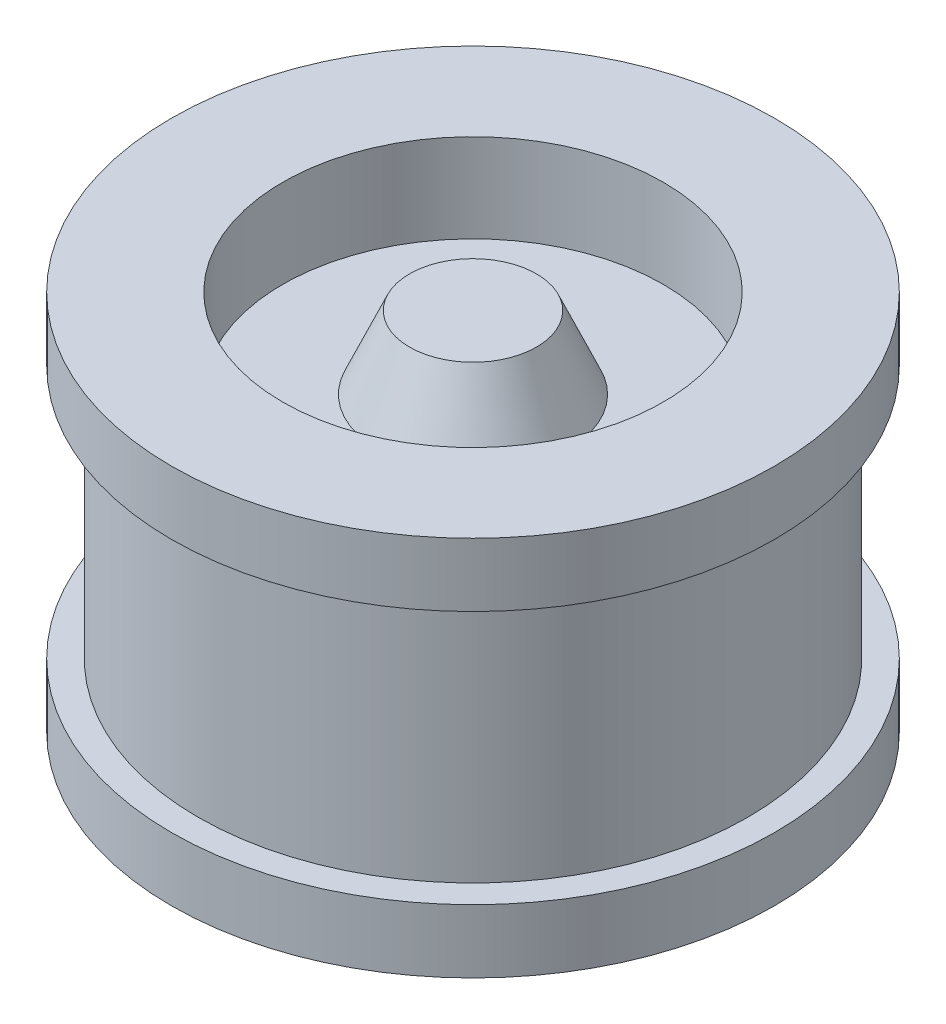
ISO-10303-21;
HEADER;
FILE_DESCRIPTION(('STEP AP214'),'2;1');
FILE_NAME('part.step','',(''),(''),'','','');
FILE_SCHEMA(('AUTOMOTIVE_DESIGN { 1 0 10303 214 1 1 1 1 }'));
ENDSEC;
DATA;
#1=APPLICATION_CONTEXT('core data for automotive mechanical design processes');
#2=APPLICATION_PROTOCOL_DEFINITION('international standard','automotive_design',2000,#1);
#3=PRODUCT_CONTEXT('',#1,'mechanical');
#4=PRODUCT('Part','Part','',(#3));
#5=PRODUCT_RELATED_PRODUCT_CATEGORY('part','',(#4));
#6=PRODUCT_DEFINITION_FORMATION('','',#4);
#7=PRODUCT_DEFINITION_CONTEXT('part definition',#1,'design');
#8=PRODUCT_DEFINITION('design','',#6,#7);
#9=PRODUCT_DEFINITION_SHAPE('','',#8);
#10=(LENGTH_UNIT() NAMED_UNIT(*) SI_UNIT(.MILLI.,.METRE.));
#11=(NAMED_UNIT(*) PLANE_ANGLE_UNIT() SI_UNIT($,.RADIAN.));
#12=(NAMED_UNIT(*) SI_UNIT($,.STERADIAN.) SOLID_ANGLE_UNIT());
#13=UNCERTAINTY_MEASURE_WITH_UNIT(LENGTH_MEASURE(1.E-05),#10,'distance_accuracy_value','');
#14=(GEOMETRIC_REPRESENTATION_CONTEXT(3) GLOBAL_UNCERTAINTY_ASSIGNED_CONTEXT((#13)) GLOBAL_UNIT_ASSIGNED_CONTEXT((#10,
#11,#12)) REPRESENTATION_CONTEXT('',''));
#15=CARTESIAN_POINT('',(0.,0.,0.));
#16=DIRECTION('',(0.,0.,1.));
#17=DIRECTION('',(1.,0.,0.));
#18=AXIS2_PLACEMENT_3D('',#15,#16,#17);
#19=CARTESIAN_POINT('',(0.,20.,0.));
#20=DIRECTION('',(0.,1.,0.));
#21=DIRECTION('',(0.,0.,1.));
#22=AXIS2_PLACEMENT_3D('',#19,#20,#21);
#23=CYLINDRICAL_SURFACE('',#22,3.);
#24=CARTESIAN_POINT('',(0.,0.,0.));
#25=DIRECTION('',(0.,1.,0.));
#26=DIRECTION('',(0.,0.,1.));
#27=AXIS2_PLACEMENT_3D('',#24,#25,#26);
#28=CIRCLE('',#27,3.);
#29=CARTESIAN_POINT('',(0.,0.,3.));
#30=VERTEX_POINT('',#29);
#31=EDGE_CURVE('E152',#30,#30,#28,.T.);
#32=ORIENTED_EDGE('',*,*,#31,.T.);
#33=EDGE_LOOP('',(#32));
#34=FACE_BOUND('',#33,.T.);
#35=DIRECTION('',(0.,1.,0.));
#36=VECTOR('',#35,1.);
#37=CARTESIAN_POINT('',(-2.95803989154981,4.,0.499999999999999));
#38=LINE('',#37,#36);
#39=CARTESIAN_POINT('',(-2.95803989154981,4.,0.499999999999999));
#40=VERTEX_POINT('',#39);
#41=CARTESIAN_POINT('',(-2.95803989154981,8.,0.499999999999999));
#42=VERTEX_POINT('',#41);
#43=EDGE_CURVE('E50',#40,#42,#38,.T.);
#44=ORIENTED_EDGE('',*,*,#43,.F.);
#45=CARTESIAN_POINT('',(0.,4.,0.));
#46=DIRECTION('',(0.,1.,0.));
#47=DIRECTION('',(0.,0.,-1.));
#48=AXIS2_PLACEMENT_3D('',#45,#46,#47);
#49=CIRCLE('',#48,3.);
#50=CARTESIAN_POINT('',(-2.95803989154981,4.,-0.5));
#51=VERTEX_POINT('',#50);
#52=EDGE_CURVE('E45',#51,#40,#49,.T.);
#53=ORIENTED_EDGE('',*,*,#52,.F.);
#54=DIRECTION('',(0.,1.,0.));
#55=VECTOR('',#54,1.);
#56=CARTESIAN_POINT('',(-2.95803989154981,4.,-0.5));
#57=LINE('',#56,#55);
#58=CARTESIAN_POINT('',(-2.95803989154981,8.,-0.5));
#59=VERTEX_POINT('',#58);
#60=EDGE_CURVE('E157',#51,#59,#57,.T.);
#61=ORIENTED_EDGE('',*,*,#60,.T.);
#62=CARTESIAN_POINT('',(0.,8.,0.));
#63=DIRECTION('',(0.,1.,0.));
#64=DIRECTION('',(0.,0.,1.));
#65=AXIS2_PLACEMENT_3D('',#62,#63,#64);
#66=CIRCLE('',#65,3.);
#67=CARTESIAN_POINT('',(-0.500000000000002,8.,-2.95803989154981));
#68=VERTEX_POINT('',#67);
#69=EDGE_CURVE('E144',#68,#59,#66,.T.);
#70=ORIENTED_EDGE('',*,*,#69,.F.);
#71=DIRECTION('',(0.,1.,0.));
#72=VECTOR('',#71,1.);
#73=CARTESIAN_POINT('',(-0.500000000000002,4.,-2.95803989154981));
#74=LINE('',#73,#72);
#75=CARTESIAN_POINT('',(-0.500000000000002,4.,-2.95803989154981));
#76=VERTEX_POINT('',#75);
#77=EDGE_CURVE('E255',#76,#68,#74,.T.);
#78=ORIENTED_EDGE('',*,*,#77,.F.);
#79=CARTESIAN_POINT('',(0.,4.,0.));
#80=DIRECTION('',(0.,1.,0.));
#81=DIRECTION('',(0.,0.,-1.));
#82=AXIS2_PLACEMENT_3D('',#79,#80,#81);
#83=CIRCLE('',#82,3.);
#84=CARTESIAN_POINT('',(0.499999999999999,4.,-2.95803989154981));
#85=VERTEX_POINT('',#84);
#86=EDGE_CURVE('E236',#85,#76,#83,.T.);
#87=ORIENTED_EDGE('',*,*,#86,.F.);
#88=DIRECTION('',(0.,1.,0.));
#89=VECTOR('',#88,1.);
#90=CARTESIAN_POINT('',(0.499999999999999,4.,-2.95803989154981));
#91=LINE('',#90,#89);
#92=CARTESIAN_POINT('',(0.499999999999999,8.,-2.95803989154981));
#93=VERTEX_POINT('',#92);
#94=EDGE_CURVE('E246',#85,#93,#91,.T.);
#95=ORIENTED_EDGE('',*,*,#94,.T.);
#96=CARTESIAN_POINT('',(2.95803989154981,8.,-0.499999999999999));
#97=VERTEX_POINT('',#96);
#98=EDGE_CURVE('E295',#97,#93,#66,.T.);
#99=ORIENTED_EDGE('',*,*,#98,.F.);
#100=DIRECTION('',(0.,1.,0.));
#101=VECTOR('',#100,1.);
#102=CARTESIAN_POINT('',(2.95803989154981,4.,-0.499999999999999));
#103=LINE('',#102,#101);
#104=CARTESIAN_POINT('',(2.95803989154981,4.,-0.499999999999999));
#105=VERTEX_POINT('',#104);
#106=EDGE_CURVE('E204',#105,#97,#103,.T.);
#107=ORIENTED_EDGE('',*,*,#106,.F.);
#108=CARTESIAN_POINT('',(0.,4.,0.));
#109=DIRECTION('',(0.,1.,0.));
#110=DIRECTION('',(0.,0.,-1.));
#111=AXIS2_PLACEMENT_3D('',#108,#109,#110);
#112=CIRCLE('',#111,3.);
#113=CARTESIAN_POINT('',(2.95803989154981,4.,0.5));
#114=VERTEX_POINT('',#113);
#115=EDGE_CURVE('E186',#114,#105,#112,.T.);
#116=ORIENTED_EDGE('',*,*,#115,.F.);
#117=DIRECTION('',(0.,1.,0.));
#118=VECTOR('',#117,1.);
#119=CARTESIAN_POINT('',(2.95803989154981,4.,0.5));
#120=LINE('',#119,#118);
#121=CARTESIAN_POINT('',(2.95803989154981,8.,0.5));
#122=VERTEX_POINT('',#121);
#123=EDGE_CURVE('E196',#114,#122,#120,.T.);
#124=ORIENTED_EDGE('',*,*,#123,.T.);
#125=CARTESIAN_POINT('',(0.499999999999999,8.,2.95803989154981));
#126=VERTEX_POINT('',#125);
#127=EDGE_CURVE('E155',#126,#122,#66,.T.);
#128=ORIENTED_EDGE('',*,*,#127,.F.);
#129=DIRECTION('',(0.,1.,0.));
#130=VECTOR('',#129,1.);
#131=CARTESIAN_POINT('',(0.499999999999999,4.,2.95803989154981));
#132=LINE('',#131,#130);
#133=CARTESIAN_POINT('',(0.499999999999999,4.,2.95803989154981));
#134=VERTEX_POINT('',#133);
#135=EDGE_CURVE('E224',#134,#126,#132,.T.);
#136=ORIENTED_EDGE('',*,*,#135,.F.);
#137=CARTESIAN_POINT('',(0.,4.,0.));
#138=DIRECTION('',(0.,1.,0.));
#139=DIRECTION('',(0.,0.,-1.));
#140=AXIS2_PLACEMENT_3D('',#137,#138,#139);
#141=CIRCLE('',#140,3.);
#142=CARTESIAN_POINT('',(-0.500000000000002,4.,2.95803989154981));
#143=VERTEX_POINT('',#142);
#144=EDGE_CURVE('E216',#143,#134,#141,.T.);
#145=ORIENTED_EDGE('',*,*,#144,.F.);
#146=DIRECTION('',(0.,1.,0.));
#147=VECTOR('',#146,1.);
#148=CARTESIAN_POINT('',(-0.500000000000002,4.,2.95803989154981));
#149=LINE('',#148,#147);
#150=CARTESIAN_POINT('',(-0.500000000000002,8.,2.95803989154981));
#151=VERTEX_POINT('',#150);
#152=EDGE_CURVE('E226',#143,#151,#149,.T.);
#153=ORIENTED_EDGE('',*,*,#152,.T.);
#154=EDGE_CURVE('E153',#42,#151,#66,.T.);
#155=ORIENTED_EDGE('',*,*,#154,.F.);
#156=EDGE_LOOP('',(#44,#53,#61,#70,#78,#87,#95,#99,#107,#116,#124,#128,#136,#145,#153,#155));
#157=FACE_BOUND('',#156,.T.);
#158=ADVANCED_FACE('F30',(#34,#157),#23,.T.);
#159=CARTESIAN_POINT('',(0.,20.,0.));
#160=DIRECTION('',(0.,1.,0.));
#161=DIRECTION('',(0.,0.,1.));
#162=AXIS2_PLACEMENT_3D('',#159,#160,#161);
#163=CYLINDRICAL_SURFACE('',#162,6.5);
#164=CARTESIAN_POINT('',(0.,2.,0.));
#165=DIRECTION('',(0.,1.,0.));
#166=DIRECTION('',(0.,0.,1.));
#167=AXIS2_PLACEMENT_3D('',#164,#165,#166);
#168=CIRCLE('',#167,6.5);
#169=CARTESIAN_POINT('',(0.,2.,6.5));
#170=VERTEX_POINT('',#169);
#171=EDGE_CURVE('E290',#170,#170,#168,.T.);
#172=ORIENTED_EDGE('',*,*,#171,.F.);
#173=EDGE_LOOP('',(#172));
#174=FACE_BOUND('',#173,.T.);
#175=DIRECTION('',(0.,1.,0.));
#176=VECTOR('',#175,1.);
#177=CARTESIAN_POINT('',(-6.48074069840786,4.,0.500000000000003));
#178=LINE('',#177,#176);
#179=CARTESIAN_POINT('',(-6.48074069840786,4.,0.499999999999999));
#180=VERTEX_POINT('',#179);
#181=CARTESIAN_POINT('',(-6.48074069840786,8.,0.500000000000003));
#182=VERTEX_POINT('',#181);
#183=EDGE_CURVE('E179',#180,#182,#178,.T.);
#184=ORIENTED_EDGE('',*,*,#183,.T.);
#185=CARTESIAN_POINT('',(0.,8.,0.));
#186=DIRECTION('',(0.,1.,0.));
#187=DIRECTION('',(0.,0.,1.));
#188=AXIS2_PLACEMENT_3D('',#185,#186,#187);
#189=CIRCLE('',#188,6.5);
#190=CARTESIAN_POINT('',(-0.500000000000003,8.,6.48074069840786));
#191=VERTEX_POINT('',#190);
#192=EDGE_CURVE('E296',#182,#191,#189,.T.);
#193=ORIENTED_EDGE('',*,*,#192,.T.);
#194=DIRECTION('',(0.,1.,0.));
#195=VECTOR('',#194,1.);
#196=CARTESIAN_POINT('',(-0.500000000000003,4.,6.48074069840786));
#197=LINE('',#196,#195);
#198=CARTESIAN_POINT('',(-0.500000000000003,4.,6.48074069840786));
#199=VERTEX_POINT('',#198);
#200=EDGE_CURVE('E229',#199,#191,#197,.T.);
#201=ORIENTED_EDGE('',*,*,#200,.F.);
#202=CARTESIAN_POINT('',(0.,4.,0.));
#203=DIRECTION('',(0.,-1.,0.));
#204=DIRECTION('',(0.,0.,-1.));
#205=AXIS2_PLACEMENT_3D('',#202,#203,#204);
#206=CIRCLE('',#205,6.5);
#207=CARTESIAN_POINT('',(0.499999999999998,4.,6.48074069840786));
#208=VERTEX_POINT('',#207);
#209=EDGE_CURVE('E211',#208,#199,#206,.T.);
#210=ORIENTED_EDGE('',*,*,#209,.F.);
#211=DIRECTION('',(0.,1.,0.));
#212=VECTOR('',#211,1.);
#213=CARTESIAN_POINT('',(0.499999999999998,4.,6.48074069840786));
#214=LINE('',#213,#212);
#215=CARTESIAN_POINT('',(0.499999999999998,8.,6.48074069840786));
#216=VERTEX_POINT('',#215);
#217=EDGE_CURVE('E221',#208,#216,#214,.T.);
#218=ORIENTED_EDGE('',*,*,#217,.T.);
#219=CARTESIAN_POINT('',(6.48074069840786,8.,0.5));
#220=VERTEX_POINT('',#219);
#221=EDGE_CURVE('E297',#216,#220,#189,.T.);
#222=ORIENTED_EDGE('',*,*,#221,.T.);
#223=DIRECTION('',(0.,1.,0.));
#224=VECTOR('',#223,1.);
#225=CARTESIAN_POINT('',(6.48074069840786,4.,0.5));
#226=LINE('',#225,#224);
#227=CARTESIAN_POINT('',(6.48074069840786,4.,0.5));
#228=VERTEX_POINT('',#227);
#229=EDGE_CURVE('E199',#228,#220,#226,.T.);
#230=ORIENTED_EDGE('',*,*,#229,.F.);
#231=CARTESIAN_POINT('',(0.,4.,0.));
#232=DIRECTION('',(0.,-1.,0.));
#233=DIRECTION('',(0.,0.,-1.));
#234=AXIS2_PLACEMENT_3D('',#231,#232,#233);
#235=CIRCLE('',#234,6.5);
#236=CARTESIAN_POINT('',(6.48074069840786,4.,-0.499999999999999));
#237=VERTEX_POINT('',#236);
#238=EDGE_CURVE('E192',#237,#228,#235,.T.);
#239=ORIENTED_EDGE('',*,*,#238,.F.);
#240=DIRECTION('',(0.,1.,0.));
#241=VECTOR('',#240,1.);
#242=CARTESIAN_POINT('',(6.48074069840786,4.,-0.499999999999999));
#243=LINE('',#242,#241);
#244=CARTESIAN_POINT('',(6.48074069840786,8.,-0.499999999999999));
#245=VERTEX_POINT('',#244);
#246=EDGE_CURVE('E201',#237,#245,#243,.T.);
#247=ORIENTED_EDGE('',*,*,#246,.T.);
#248=CARTESIAN_POINT('',(0.499999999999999,8.,-6.48074069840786));
#249=VERTEX_POINT('',#248);
#250=EDGE_CURVE('E293',#245,#249,#189,.T.);
#251=ORIENTED_EDGE('',*,*,#250,.T.);
#252=DIRECTION('',(0.,1.,0.));
#253=VECTOR('',#252,1.);
#254=CARTESIAN_POINT('',(0.499999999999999,4.,-6.48074069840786));
#255=LINE('',#254,#253);
#256=CARTESIAN_POINT('',(0.499999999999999,4.,-6.48074069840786));
#257=VERTEX_POINT('',#256);
#258=EDGE_CURVE('E249',#257,#249,#255,.T.);
#259=ORIENTED_EDGE('',*,*,#258,.F.);
#260=CARTESIAN_POINT('',(0.,4.,0.));
#261=DIRECTION('',(0.,-1.,0.));
#262=DIRECTION('',(0.,0.,-1.));
#263=AXIS2_PLACEMENT_3D('',#260,#261,#262);
#264=CIRCLE('',#263,6.5);
#265=CARTESIAN_POINT('',(-0.500000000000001,4.,-6.48074069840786));
#266=VERTEX_POINT('',#265);
#267=EDGE_CURVE('E242',#266,#257,#264,.T.);
#268=ORIENTED_EDGE('',*,*,#267,.F.);
#269=DIRECTION('',(0.,1.,0.));
#270=VECTOR('',#269,1.);
#271=CARTESIAN_POINT('',(-0.500000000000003,4.,-6.48074069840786));
#272=LINE('',#271,#270);
#273=CARTESIAN_POINT('',(-0.500000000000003,8.,-6.48074069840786));
#274=VERTEX_POINT('',#273);
#275=EDGE_CURVE('E252',#266,#274,#272,.T.);
#276=ORIENTED_EDGE('',*,*,#275,.T.);
#277=CARTESIAN_POINT('',(-6.48074069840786,8.,-0.5));
#278=VERTEX_POINT('',#277);
#279=EDGE_CURVE('E294',#274,#278,#189,.T.);
#280=ORIENTED_EDGE('',*,*,#279,.T.);
#281=DIRECTION('',(0.,1.,0.));
#282=VECTOR('',#281,1.);
#283=CARTESIAN_POINT('',(-6.48074069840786,4.,-0.5));
#284=LINE('',#283,#282);
#285=CARTESIAN_POINT('',(-6.48074069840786,4.,-0.5));
#286=VERTEX_POINT('',#285);
#287=EDGE_CURVE('E160',#286,#278,#284,.T.);
#288=ORIENTED_EDGE('',*,*,#287,.F.);
#289=CARTESIAN_POINT('',(0.,4.,0.));
#290=DIRECTION('',(0.,-1.,0.));
#291=DIRECTION('',(0.,0.,-1.));
#292=AXIS2_PLACEMENT_3D('',#289,#290,#291);
#293=CIRCLE('',#292,6.5);
#294=EDGE_CURVE('E174',#180,#286,#293,.T.);
#295=ORIENTED_EDGE('',*,*,#294,.F.);
#296=EDGE_LOOP('',(#184,#193,#201,#210,#218,#222,#230,#239,#247,#251,#259,#268,#276,#280,#288,#295));
#297=FACE_BOUND('',#296,.T.);
#298=ADVANCED_FACE('F321',(#174,#297),#163,.F.);
#299=CARTESIAN_POINT('',(3.,8.,0.));
#300=DIRECTION('',(0.,1.,0.));
#301=DIRECTION('',(0.,0.,1.));
#302=AXIS2_PLACEMENT_3D('',#299,#300,#301);
#303=PLANE('',#302);
#304=DIRECTION('',(-1.,0.,0.));
#305=VECTOR('',#304,1.);
#306=CARTESIAN_POINT('',(-2.95803989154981,8.,0.499999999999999));
#307=LINE('',#306,#305);
#308=EDGE_CURVE('E165',#42,#182,#307,.T.);
#309=ORIENTED_EDGE('',*,*,#308,.F.);
#310=ORIENTED_EDGE('',*,*,#154,.T.);
#311=DIRECTION('',(0.,0.,-1.));
#312=VECTOR('',#311,1.);
#313=CARTESIAN_POINT('',(-0.500000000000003,8.,6.48074069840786));
#314=LINE('',#313,#312);
#315=EDGE_CURVE('E206',#191,#151,#314,.T.);
#316=ORIENTED_EDGE('',*,*,#315,.F.);
#317=ORIENTED_EDGE('',*,*,#192,.F.);
#318=EDGE_LOOP('',(#309,#310,#316,#317));
#319=FACE_BOUND('',#318,.T.);
#320=ADVANCED_FACE('F326',(#319),#303,.F.);
#321=DIRECTION('',(1.,0.,0.));
#322=VECTOR('',#321,1.);
#323=CARTESIAN_POINT('',(-2.95803989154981,8.,-0.5));
#324=LINE('',#323,#322);
#325=EDGE_CURVE('E148',#278,#59,#324,.T.);
#326=ORIENTED_EDGE('',*,*,#325,.F.);
#327=ORIENTED_EDGE('',*,*,#279,.F.);
#328=DIRECTION('',(0.,0.,-1.));
#329=VECTOR('',#328,1.);
#330=CARTESIAN_POINT('',(-0.500000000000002,8.,-2.95803989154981));
#331=LINE('',#330,#329);
#332=EDGE_CURVE('E150',#68,#274,#331,.T.);
#333=ORIENTED_EDGE('',*,*,#332,.F.);
#334=ORIENTED_EDGE('',*,*,#69,.T.);
#335=EDGE_LOOP('',(#326,#327,#333,#334));
#336=FACE_BOUND('',#335,.T.);
#337=ADVANCED_FACE('F145',(#336),#303,.F.);
#338=DIRECTION('',(1.,0.,0.));
#339=VECTOR('',#338,1.);
#340=CARTESIAN_POINT('',(6.48074069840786,8.,-0.499999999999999));
#341=LINE('',#340,#339);
#342=EDGE_CURVE('E182',#97,#245,#341,.T.);
#343=ORIENTED_EDGE('',*,*,#342,.F.);
#344=ORIENTED_EDGE('',*,*,#98,.T.);
#345=DIRECTION('',(0.,0.,1.));
#346=VECTOR('',#345,1.);
#347=CARTESIAN_POINT('',(0.499999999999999,8.,-2.95803989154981));
#348=LINE('',#347,#346);
#349=EDGE_CURVE('E233',#249,#93,#348,.T.);
#350=ORIENTED_EDGE('',*,*,#349,.F.);
#351=ORIENTED_EDGE('',*,*,#250,.F.);
#352=EDGE_LOOP('',(#343,#344,#350,#351));
#353=FACE_BOUND('',#352,.T.);
#354=ADVANCED_FACE('F391',(#353),#303,.F.);
#355=DIRECTION('',(-1.,0.,0.));
#356=VECTOR('',#355,1.);
#357=CARTESIAN_POINT('',(6.48074069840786,8.,0.5));
#358=LINE('',#357,#356);
#359=EDGE_CURVE('E184',#220,#122,#358,.T.);
#360=ORIENTED_EDGE('',*,*,#359,.F.);
#361=ORIENTED_EDGE('',*,*,#221,.F.);
#362=DIRECTION('',(0.,0.,1.));
#363=VECTOR('',#362,1.);
#364=CARTESIAN_POINT('',(0.499999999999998,8.,6.48074069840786));
#365=LINE('',#364,#363);
#366=EDGE_CURVE('E209',#126,#216,#365,.T.);
#367=ORIENTED_EDGE('',*,*,#366,.F.);
#368=ORIENTED_EDGE('',*,*,#127,.T.);
#369=EDGE_LOOP('',(#360,#361,#367,#368));
#370=FACE_BOUND('',#369,.T.);
#371=ADVANCED_FACE('F332',(#370),#303,.F.);
#372=CARTESIAN_POINT('',(0.,0.,0.));
#373=DIRECTION('',(0.,1.,0.));
#374=DIRECTION('',(0.,0.,1.));
#375=AXIS2_PLACEMENT_3D('',#372,#373,#374);
#376=PLANE('',#375);
#377=CARTESIAN_POINT('',(0.,0.,0.));
#378=DIRECTION('',(0.,-1.,0.));
#379=DIRECTION('',(0.,0.,-1.));
#380=AXIS2_PLACEMENT_3D('',#377,#378,#379);
#381=CIRCLE('',#380,0.999999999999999);
#382=CARTESIAN_POINT('',(0.,0.,-0.999999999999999));
#383=VERTEX_POINT('',#382);
#384=EDGE_CURVE('E257',#383,#383,#381,.T.);
#385=ORIENTED_EDGE('',*,*,#384,.F.);
#386=EDGE_LOOP('',(#385));
#387=FACE_BOUND('',#386,.T.);
#388=ORIENTED_EDGE('',*,*,#31,.F.);
#389=EDGE_LOOP('',(#388));
#390=FACE_BOUND('',#389,.T.);
#391=ADVANCED_FACE('F32',(#387,#390),#376,.F.);
#392=CARTESIAN_POINT('',(6.5,2.,0.));
#393=DIRECTION('',(0.,1.,0.));
#394=DIRECTION('',(0.,0.,1.));
#395=AXIS2_PLACEMENT_3D('',#392,#393,#394);
#396=PLANE('',#395);
#397=CARTESIAN_POINT('',(0.,2.,0.));
#398=DIRECTION('',(0.,1.,0.));
#399=DIRECTION('',(0.,0.,1.));
#400=AXIS2_PLACEMENT_3D('',#397,#398,#399);
#401=CIRCLE('',#400,9.5);
#402=CARTESIAN_POINT('',(0.,2.,9.5));
#403=VERTEX_POINT('',#402);
#404=EDGE_CURVE('E287',#403,#403,#401,.T.);
#405=ORIENTED_EDGE('',*,*,#404,.F.);
#406=EDGE_LOOP('',(#405));
#407=FACE_BOUND('',#406,.T.);
#408=ORIENTED_EDGE('',*,*,#171,.T.);
#409=EDGE_LOOP('',(#408));
#410=FACE_BOUND('',#409,.T.);
#411=ADVANCED_FACE('F334',(#407,#410),#396,.F.);
#412=CARTESIAN_POINT('',(0.,20.,0.));
#413=DIRECTION('',(0.,1.,0.));
#414=DIRECTION('',(0.,0.,1.));
#415=AXIS2_PLACEMENT_3D('',#412,#413,#414);
#416=CYLINDRICAL_SURFACE('',#415,9.5);
#417=CARTESIAN_POINT('',(0.,4.,0.));
#418=DIRECTION('',(0.,1.,0.));
#419=DIRECTION('',(0.,0.,1.));
#420=AXIS2_PLACEMENT_3D('',#417,#418,#419);
#421=CIRCLE('',#420,9.5);
#422=CARTESIAN_POINT('',(0.,4.,9.5));
#423=VERTEX_POINT('',#422);
#424=EDGE_CURVE('E284',#423,#423,#421,.T.);
#425=ORIENTED_EDGE('',*,*,#424,.F.);
#426=EDGE_LOOP('',(#425));
#427=FACE_BOUND('',#426,.T.);
#428=ORIENTED_EDGE('',*,*,#404,.T.);
#429=EDGE_LOOP('',(#428));
#430=FACE_BOUND('',#429,.T.);
#431=ADVANCED_FACE('F337',(#427,#430),#416,.T.);
#432=CARTESIAN_POINT('',(9.5,4.,0.));
#433=DIRECTION('',(0.,-1.,0.));
#434=DIRECTION('',(0.,0.,-1.));
#435=AXIS2_PLACEMENT_3D('',#432,#433,#434);
#436=PLANE('',#435);
#437=CARTESIAN_POINT('',(0.,4.,0.));
#438=DIRECTION('',(0.,1.,0.));
#439=DIRECTION('',(0.,0.,1.));
#440=AXIS2_PLACEMENT_3D('',#437,#438,#439);
#441=CIRCLE('',#440,8.66254051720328);
#442=CARTESIAN_POINT('',(0.,4.,8.66254051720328));
#443=VERTEX_POINT('',#442);
#444=EDGE_CURVE('E281',#443,#443,#441,.T.);
#445=ORIENTED_EDGE('',*,*,#444,.F.);
#446=EDGE_LOOP('',(#445));
#447=FACE_BOUND('',#446,.T.);
#448=ORIENTED_EDGE('',*,*,#424,.T.);
#449=EDGE_LOOP('',(#448));
#450=FACE_BOUND('',#449,.T.);
#451=ADVANCED_FACE('F341',(#447,#450),#436,.F.);
#452=CARTESIAN_POINT('',(0.,20.,0.));
#453=DIRECTION('',(0.,1.,0.));
#454=DIRECTION('',(0.,0.,1.));
#455=AXIS2_PLACEMENT_3D('',#452,#453,#454);
#456=CYLINDRICAL_SURFACE('',#455,8.66254051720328);
#457=CARTESIAN_POINT('',(0.,12.,0.));
#458=DIRECTION('',(0.,1.,0.));
#459=DIRECTION('',(0.,0.,1.));
#460=AXIS2_PLACEMENT_3D('',#457,#458,#459);
#461=CIRCLE('',#460,8.66254051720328);
#462=CARTESIAN_POINT('',(0.,12.,8.66254051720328));
#463=VERTEX_POINT('',#462);
#464=EDGE_CURVE('E278',#463,#463,#461,.T.);
#465=ORIENTED_EDGE('',*,*,#464,.F.);
#466=EDGE_LOOP('',(#465));
#467=FACE_BOUND('',#466,.T.);
#468=ORIENTED_EDGE('',*,*,#444,.T.);
#469=EDGE_LOOP('',(#468));
#470=FACE_BOUND('',#469,.T.);
#471=ADVANCED_FACE('F345',(#467,#470),#456,.T.);
#472=CARTESIAN_POINT('',(8.66254051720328,12.,0.));
#473=DIRECTION('',(0.,1.,0.));
#474=DIRECTION('',(0.,0.,1.));
#475=AXIS2_PLACEMENT_3D('',#472,#473,#474);
#476=PLANE('',#475);
#477=CARTESIAN_POINT('',(0.,12.,0.));
#478=DIRECTION('',(0.,1.,0.));
#479=DIRECTION('',(0.,0.,1.));
#480=AXIS2_PLACEMENT_3D('',#477,#478,#479);
#481=CIRCLE('',#480,9.49999999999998);
#482=CARTESIAN_POINT('',(0.,12.,9.49999999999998));
#483=VERTEX_POINT('',#482);
#484=EDGE_CURVE('E275',#483,#483,#481,.T.);
#485=ORIENTED_EDGE('',*,*,#484,.F.);
#486=EDGE_LOOP('',(#485));
#487=FACE_BOUND('',#486,.T.);
#488=ORIENTED_EDGE('',*,*,#464,.T.);
#489=EDGE_LOOP('',(#488));
#490=FACE_BOUND('',#489,.T.);
#491=ADVANCED_FACE('F349',(#487,#490),#476,.F.);
#492=CARTESIAN_POINT('',(0.,20.,0.));
#493=DIRECTION('',(0.,1.,0.));
#494=DIRECTION('',(0.,0.,1.));
#495=AXIS2_PLACEMENT_3D('',#492,#493,#494);
#496=CYLINDRICAL_SURFACE('',#495,9.49999999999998);
#497=CARTESIAN_POINT('',(0.,14.,0.));
#498=DIRECTION('',(0.,1.,0.));
#499=DIRECTION('',(0.,0.,1.));
#500=AXIS2_PLACEMENT_3D('',#497,#498,#499);
#501=CIRCLE('',#500,9.49999999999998);
#502=CARTESIAN_POINT('',(0.,14.,9.49999999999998));
#503=VERTEX_POINT('',#502);
#504=EDGE_CURVE('E272',#503,#503,#501,.T.);
#505=ORIENTED_EDGE('',*,*,#504,.F.);
#506=EDGE_LOOP('',(#505));
#507=FACE_BOUND('',#506,.T.);
#508=ORIENTED_EDGE('',*,*,#484,.T.);
#509=EDGE_LOOP('',(#508));
#510=FACE_BOUND('',#509,.T.);
#511=ADVANCED_FACE('F353',(#507,#510),#496,.T.);
#512=CARTESIAN_POINT('',(9.49999999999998,14.,0.));
#513=DIRECTION('',(0.,-1.,0.));
#514=DIRECTION('',(0.,0.,-1.));
#515=AXIS2_PLACEMENT_3D('',#512,#513,#514);
#516=PLANE('',#515);
#517=CARTESIAN_POINT('',(0.,14.,0.));
#518=DIRECTION('',(0.,1.,0.));
#519=DIRECTION('',(0.,0.,1.));
#520=AXIS2_PLACEMENT_3D('',#517,#518,#519);
#521=CIRCLE('',#520,5.9993782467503);
#522=CARTESIAN_POINT('',(0.,14.,5.9993782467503));
#523=VERTEX_POINT('',#522);
#524=EDGE_CURVE('E269',#523,#523,#521,.T.);
#525=ORIENTED_EDGE('',*,*,#524,.F.);
#526=EDGE_LOOP('',(#525));
#527=FACE_BOUND('',#526,.T.);
#528=ORIENTED_EDGE('',*,*,#504,.T.);
#529=EDGE_LOOP('',(#528));
#530=FACE_BOUND('',#529,.T.);
#531=ADVANCED_FACE('F357',(#527,#530),#516,.F.);
#532=CARTESIAN_POINT('',(0.,20.,0.));
#533=DIRECTION('',(0.,1.,0.));
#534=DIRECTION('',(0.,0.,1.));
#535=AXIS2_PLACEMENT_3D('',#532,#533,#534);
#536=CYLINDRICAL_SURFACE('',#535,5.9993782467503);
#537=CARTESIAN_POINT('',(0.,11.212054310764,0.));
#538=DIRECTION('',(0.,1.,0.));
#539=DIRECTION('',(0.,0.,1.));
#540=AXIS2_PLACEMENT_3D('',#537,#538,#539);
#541=CIRCLE('',#540,5.9993782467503);
#542=CARTESIAN_POINT('',(0.,11.212054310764,5.9993782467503));
#543=VERTEX_POINT('',#542);
#544=EDGE_CURVE('E266',#543,#543,#541,.T.);
#545=ORIENTED_EDGE('',*,*,#544,.F.);
#546=EDGE_LOOP('',(#545));
#547=FACE_BOUND('',#546,.T.);
#548=ORIENTED_EDGE('',*,*,#524,.T.);
#549=EDGE_LOOP('',(#548));
#550=FACE_BOUND('',#549,.T.);
#551=ADVANCED_FACE('F361',(#547,#550),#536,.F.);
#552=CARTESIAN_POINT('',(5.9993782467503,11.212054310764,0.));
#553=DIRECTION('',(0.,-1.,0.));
#554=DIRECTION('',(0.,0.,-1.));
#555=AXIS2_PLACEMENT_3D('',#552,#553,#554);
#556=PLANE('',#555);
#557=CARTESIAN_POINT('',(0.,11.212054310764,0.));
#558=DIRECTION('',(0.,1.,0.));
#559=DIRECTION('',(0.,0.,1.));
#560=AXIS2_PLACEMENT_3D('',#557,#558,#559);
#561=CIRCLE('',#560,3.);
#562=CARTESIAN_POINT('',(0.,11.212054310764,3.));
#563=VERTEX_POINT('',#562);
#564=EDGE_CURVE('E263',#563,#563,#561,.T.);
#565=ORIENTED_EDGE('',*,*,#564,.F.);
#566=EDGE_LOOP('',(#565));
#567=FACE_BOUND('',#566,.T.);
#568=ORIENTED_EDGE('',*,*,#544,.T.);
#569=EDGE_LOOP('',(#568));
#570=FACE_BOUND('',#569,.T.);
#571=ADVANCED_FACE('F365',(#567,#570),#556,.F.);
#572=CARTESIAN_POINT('',(0.,11.212054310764,0.));
#573=DIRECTION('',(0.,-1.,0.));
#574=DIRECTION('',(0.,0.,-1.));
#575=AXIS2_PLACEMENT_3D('',#572,#573,#574);
#576=CONICAL_SURFACE('',#575,3.,0.412052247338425);
#577=CARTESIAN_POINT('',(0.,13.5,0.));
#578=DIRECTION('',(0.,1.,0.));
#579=DIRECTION('',(0.,0.,1.));
#580=AXIS2_PLACEMENT_3D('',#577,#578,#579);
#581=CIRCLE('',#580,2.);
#582=CARTESIAN_POINT('',(0.,13.5,2.));
#583=VERTEX_POINT('',#582);
#584=EDGE_CURVE('E260',#583,#583,#581,.T.);
#585=ORIENTED_EDGE('',*,*,#584,.F.);
#586=EDGE_LOOP('',(#585));
#587=FACE_BOUND('',#586,.T.);
#588=ORIENTED_EDGE('',*,*,#564,.T.);
#589=EDGE_LOOP('',(#588));
#590=FACE_BOUND('',#589,.T.);
#591=ADVANCED_FACE('F369',(#587,#590),#576,.T.);
#592=CARTESIAN_POINT('',(2.,13.5,0.));
#593=DIRECTION('',(0.,-1.,0.));
#594=DIRECTION('',(0.,0.,-1.));
#595=AXIS2_PLACEMENT_3D('',#592,#593,#594);
#596=PLANE('',#595);
#597=ORIENTED_EDGE('',*,*,#584,.T.);
#598=EDGE_LOOP('',(#597));
#599=FACE_BOUND('',#598,.T.);
#600=ADVANCED_FACE('F373',(#599),#596,.F.);
#601=CARTESIAN_POINT('',(0.,5.5,0.));
#602=DIRECTION('',(0.,-1.,0.));
#603=DIRECTION('',(0.,0.,-1.));
#604=AXIS2_PLACEMENT_3D('',#601,#602,#603);
#605=CYLINDRICAL_SURFACE('',#604,0.999999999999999);
#606=CARTESIAN_POINT('',(0.,5.25,0.));
#607=DIRECTION('',(0.,-1.,0.));
#608=DIRECTION('',(0.,0.,-1.));
#609=AXIS2_PLACEMENT_3D('',#606,#607,#608);
#610=CIRCLE('',#609,0.999999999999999);
#611=CARTESIAN_POINT('',(0.,5.25,-0.999999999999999));
#612=VERTEX_POINT('',#611);
#613=EDGE_CURVE('E11',#612,#612,#610,.F.);
#614=ORIENTED_EDGE('',*,*,#613,.T.);
#615=EDGE_LOOP('',(#614));
#616=FACE_BOUND('',#615,.T.);
#617=ORIENTED_EDGE('',*,*,#384,.T.);
#618=EDGE_LOOP('',(#617));
#619=FACE_BOUND('',#618,.T.);
#620=ADVANCED_FACE('F317',(#616,#619),#605,.F.);
#621=CARTESIAN_POINT('',(0.,5.5,0.));
#622=DIRECTION('',(0.,-1.,0.));
#623=DIRECTION('',(0.,0.,-1.));
#624=AXIS2_PLACEMENT_3D('',#621,#622,#623);
#625=PLANE('',#624);
#626=CARTESIAN_POINT('',(0.,5.5,0.));
#627=DIRECTION('',(0.,-1.,0.));
#628=DIRECTION('',(0.,0.,-1.));
#629=AXIS2_PLACEMENT_3D('',#626,#627,#628);
#630=CIRCLE('',#629,0.749999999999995);
#631=CARTESIAN_POINT('',(0.,5.5,-0.749999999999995));
#632=VERTEX_POINT('',#631);
#633=EDGE_CURVE('E38',#632,#632,#630,.T.);
#634=ORIENTED_EDGE('',*,*,#633,.T.);
#635=EDGE_LOOP('',(#634));
#636=FACE_BOUND('',#635,.T.);
#637=ADVANCED_FACE('F303',(#636),#625,.T.);
#638=CARTESIAN_POINT('',(0.,5.5,0.));
#639=DIRECTION('',(0.,-1.,0.));
#640=DIRECTION('',(0.,0.,-1.));
#641=AXIS2_PLACEMENT_3D('',#638,#639,#640);
#642=CONICAL_SURFACE('',#641,0.749999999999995,0.785398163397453);
#643=ORIENTED_EDGE('',*,*,#613,.F.);
#644=EDGE_LOOP('',(#643));
#645=FACE_BOUND('',#644,.T.);
#646=ORIENTED_EDGE('',*,*,#633,.F.);
#647=EDGE_LOOP('',(#646));
#648=FACE_BOUND('',#647,.T.);
#649=ADVANCED_FACE('F305',(#645,#648),#642,.F.);
#650=CARTESIAN_POINT('',(-0.500000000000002,4.,-2.95803989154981));
#651=DIRECTION('',(1.,0.,0.));
#652=DIRECTION('',(0.,0.,-1.));
#653=AXIS2_PLACEMENT_3D('',#650,#651,#652);
#654=PLANE('',#653);
#655=ORIENTED_EDGE('',*,*,#332,.T.);
#656=ORIENTED_EDGE('',*,*,#275,.F.);
#657=DIRECTION('',(0.,0.,-1.));
#658=VECTOR('',#657,1.);
#659=CARTESIAN_POINT('',(-0.500000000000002,4.,-2.95803989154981));
#660=LINE('',#659,#658);
#661=EDGE_CURVE('E239',#76,#266,#660,.T.);
#662=ORIENTED_EDGE('',*,*,#661,.F.);
#663=ORIENTED_EDGE('',*,*,#77,.T.);
#664=EDGE_LOOP('',(#655,#656,#662,#663));
#665=FACE_BOUND('',#664,.T.);
#666=ADVANCED_FACE('F307',(#665),#654,.F.);
#667=CARTESIAN_POINT('',(0.499999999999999,4.,-2.95803989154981));
#668=DIRECTION('',(-1.,0.,0.));
#669=DIRECTION('',(0.,0.,1.));
#670=AXIS2_PLACEMENT_3D('',#667,#668,#669);
#671=PLANE('',#670);
#672=ORIENTED_EDGE('',*,*,#349,.T.);
#673=ORIENTED_EDGE('',*,*,#94,.F.);
#674=DIRECTION('',(0.,0.,1.));
#675=VECTOR('',#674,1.);
#676=CARTESIAN_POINT('',(0.499999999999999,4.,-2.95803989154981));
#677=LINE('',#676,#675);
#678=EDGE_CURVE('E244',#257,#85,#677,.T.);
#679=ORIENTED_EDGE('',*,*,#678,.F.);
#680=ORIENTED_EDGE('',*,*,#258,.T.);
#681=EDGE_LOOP('',(#672,#673,#679,#680));
#682=FACE_BOUND('',#681,.T.);
#683=ADVANCED_FACE('F314',(#682),#671,.F.);
#684=CARTESIAN_POINT('',(0.,4.,0.));
#685=DIRECTION('',(0.,-1.,0.));
#686=DIRECTION('',(0.,0.,-1.));
#687=AXIS2_PLACEMENT_3D('',#684,#685,#686);
#688=PLANE('',#687);
#689=ORIENTED_EDGE('',*,*,#86,.T.);
#690=ORIENTED_EDGE('',*,*,#661,.T.);
#691=ORIENTED_EDGE('',*,*,#267,.T.);
#692=ORIENTED_EDGE('',*,*,#678,.T.);
#693=EDGE_LOOP('',(#689,#690,#691,#692));
#694=FACE_BOUND('',#693,.T.);
#695=ADVANCED_FACE('F453',(#694),#688,.T.);
#696=CARTESIAN_POINT('',(-0.500000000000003,4.,6.48074069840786));
#697=DIRECTION('',(1.,0.,0.));
#698=DIRECTION('',(0.,0.,-1.));
#699=AXIS2_PLACEMENT_3D('',#696,#697,#698);
#700=PLANE('',#699);
#701=ORIENTED_EDGE('',*,*,#315,.T.);
#702=ORIENTED_EDGE('',*,*,#152,.F.);
#703=DIRECTION('',(0.,0.,-1.));
#704=VECTOR('',#703,1.);
#705=CARTESIAN_POINT('',(-0.500000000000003,4.,6.48074069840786));
#706=LINE('',#705,#704);
#707=EDGE_CURVE('E214',#199,#143,#706,.T.);
#708=ORIENTED_EDGE('',*,*,#707,.F.);
#709=ORIENTED_EDGE('',*,*,#200,.T.);
#710=EDGE_LOOP('',(#701,#702,#708,#709));
#711=FACE_BOUND('',#710,.T.);
#712=ADVANCED_FACE('F423',(#711),#700,.F.);
#713=CARTESIAN_POINT('',(0.499999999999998,4.,6.48074069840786));
#714=DIRECTION('',(-1.,0.,0.));
#715=DIRECTION('',(0.,0.,1.));
#716=AXIS2_PLACEMENT_3D('',#713,#714,#715);
#717=PLANE('',#716);
#718=ORIENTED_EDGE('',*,*,#366,.T.);
#719=ORIENTED_EDGE('',*,*,#217,.F.);
#720=DIRECTION('',(0.,0.,1.));
#721=VECTOR('',#720,1.);
#722=CARTESIAN_POINT('',(0.499999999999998,4.,6.48074069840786));
#723=LINE('',#722,#721);
#724=EDGE_CURVE('E218',#134,#208,#723,.T.);
#725=ORIENTED_EDGE('',*,*,#724,.F.);
#726=ORIENTED_EDGE('',*,*,#135,.T.);
#727=EDGE_LOOP('',(#718,#719,#725,#726));
#728=FACE_BOUND('',#727,.T.);
#729=ADVANCED_FACE('F431',(#728),#717,.F.);
#730=CARTESIAN_POINT('',(0.,4.,0.));
#731=DIRECTION('',(0.,-1.,0.));
#732=DIRECTION('',(0.,0.,-1.));
#733=AXIS2_PLACEMENT_3D('',#730,#731,#732);
#734=PLANE('',#733);
#735=ORIENTED_EDGE('',*,*,#209,.T.);
#736=ORIENTED_EDGE('',*,*,#707,.T.);
#737=ORIENTED_EDGE('',*,*,#144,.T.);
#738=ORIENTED_EDGE('',*,*,#724,.T.);
#739=EDGE_LOOP('',(#735,#736,#737,#738));
#740=FACE_BOUND('',#739,.T.);
#741=ADVANCED_FACE('F429',(#740),#734,.T.);
#742=CARTESIAN_POINT('',(6.48074069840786,4.,-0.499999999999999));
#743=DIRECTION('',(0.,0.,1.));
#744=DIRECTION('',(1.,0.,0.));
#745=AXIS2_PLACEMENT_3D('',#742,#743,#744);
#746=PLANE('',#745);
#747=ORIENTED_EDGE('',*,*,#342,.T.);
#748=ORIENTED_EDGE('',*,*,#246,.F.);
#749=DIRECTION('',(1.,0.,0.));
#750=VECTOR('',#749,1.);
#751=CARTESIAN_POINT('',(6.48074069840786,4.,-0.499999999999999));
#752=LINE('',#751,#750);
#753=EDGE_CURVE('E189',#105,#237,#752,.T.);
#754=ORIENTED_EDGE('',*,*,#753,.F.);
#755=ORIENTED_EDGE('',*,*,#106,.T.);
#756=EDGE_LOOP('',(#747,#748,#754,#755));
#757=FACE_BOUND('',#756,.T.);
#758=ADVANCED_FACE('F438',(#757),#746,.F.);
#759=CARTESIAN_POINT('',(6.48074069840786,4.,0.5));
#760=DIRECTION('',(0.,0.,-1.));
#761=DIRECTION('',(-1.,0.,0.));
#762=AXIS2_PLACEMENT_3D('',#759,#760,#761);
#763=PLANE('',#762);
#764=ORIENTED_EDGE('',*,*,#359,.T.);
#765=ORIENTED_EDGE('',*,*,#123,.F.);
#766=DIRECTION('',(-1.,0.,0.));
#767=VECTOR('',#766,1.);
#768=CARTESIAN_POINT('',(6.48074069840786,4.,0.5));
#769=LINE('',#768,#767);
#770=EDGE_CURVE('E194',#228,#114,#769,.T.);
#771=ORIENTED_EDGE('',*,*,#770,.F.);
#772=ORIENTED_EDGE('',*,*,#229,.T.);
#773=EDGE_LOOP('',(#764,#765,#771,#772));
#774=FACE_BOUND('',#773,.T.);
#775=ADVANCED_FACE('F434',(#774),#763,.F.);
#776=CARTESIAN_POINT('',(0.,4.,0.));
#777=DIRECTION('',(0.,-1.,0.));
#778=DIRECTION('',(0.,0.,-1.));
#779=AXIS2_PLACEMENT_3D('',#776,#777,#778);
#780=PLANE('',#779);
#781=ORIENTED_EDGE('',*,*,#115,.T.);
#782=ORIENTED_EDGE('',*,*,#753,.T.);
#783=ORIENTED_EDGE('',*,*,#238,.T.);
#784=ORIENTED_EDGE('',*,*,#770,.T.);
#785=EDGE_LOOP('',(#781,#782,#783,#784));
#786=FACE_BOUND('',#785,.T.);
#787=ADVANCED_FACE('F436',(#786),#780,.T.);
#788=CARTESIAN_POINT('',(-2.95803989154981,4.,0.499999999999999));
#789=DIRECTION('',(0.,0.,-1.));
#790=DIRECTION('',(-1.,0.,0.));
#791=AXIS2_PLACEMENT_3D('',#788,#789,#790);
#792=PLANE('',#791);
#793=ORIENTED_EDGE('',*,*,#308,.T.);
#794=ORIENTED_EDGE('',*,*,#183,.F.);
#795=DIRECTION('',(-1.,0.,0.));
#796=VECTOR('',#795,1.);
#797=CARTESIAN_POINT('',(-2.95803989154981,4.,0.499999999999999));
#798=LINE('',#797,#796);
#799=EDGE_CURVE('E167',#40,#180,#798,.T.);
#800=ORIENTED_EDGE('',*,*,#799,.F.);
#801=ORIENTED_EDGE('',*,*,#43,.T.);
#802=EDGE_LOOP('',(#793,#794,#800,#801));
#803=FACE_BOUND('',#802,.T.);
#804=ADVANCED_FACE('F497',(#803),#792,.F.);
#805=CARTESIAN_POINT('',(-2.95803989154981,4.,-0.5));
#806=DIRECTION('',(0.,0.,1.));
#807=DIRECTION('',(1.,0.,0.));
#808=AXIS2_PLACEMENT_3D('',#805,#806,#807);
#809=PLANE('',#808);
#810=ORIENTED_EDGE('',*,*,#325,.T.);
#811=ORIENTED_EDGE('',*,*,#60,.F.);
#812=DIRECTION('',(1.,0.,0.));
#813=VECTOR('',#812,1.);
#814=CARTESIAN_POINT('',(-2.95803989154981,4.,-0.5));
#815=LINE('',#814,#813);
#816=EDGE_CURVE('E161',#286,#51,#815,.T.);
#817=ORIENTED_EDGE('',*,*,#816,.F.);
#818=ORIENTED_EDGE('',*,*,#287,.T.);
#819=EDGE_LOOP('',(#810,#811,#817,#818));
#820=FACE_BOUND('',#819,.T.);
#821=ADVANCED_FACE('F164',(#820),#809,.F.);
#822=CARTESIAN_POINT('',(0.,4.,0.));
#823=DIRECTION('',(0.,-1.,0.));
#824=DIRECTION('',(0.,0.,-1.));
#825=AXIS2_PLACEMENT_3D('',#822,#823,#824);
#826=PLANE('',#825);
#827=ORIENTED_EDGE('',*,*,#52,.T.);
#828=ORIENTED_EDGE('',*,*,#799,.T.);
#829=ORIENTED_EDGE('',*,*,#294,.T.);
#830=ORIENTED_EDGE('',*,*,#816,.T.);
#831=EDGE_LOOP('',(#827,#828,#829,#830));
#832=FACE_BOUND('',#831,.T.);
#833=ADVANCED_FACE('F514',(#832),#826,.T.);
#834=CLOSED_SHELL('',(#158,#298,#320,#337,#354,#371,#391,#411,#431,#451,#471,#491,#511,#531,
#551,#571,#591,#600,#620,#637,#649,#666,#683,#695,#712,#729,#741,#758,#775,#787,#804,#821,#833));
#835=MANIFOLD_SOLID_BREP('B2',#834);
#836=ADVANCED_BREP_SHAPE_REPRESENTATION('',(#18,#835),#14);
#837=SHAPE_DEFINITION_REPRESENTATION(#9,#836);
ENDSEC;
END-ISO-10303-21;
